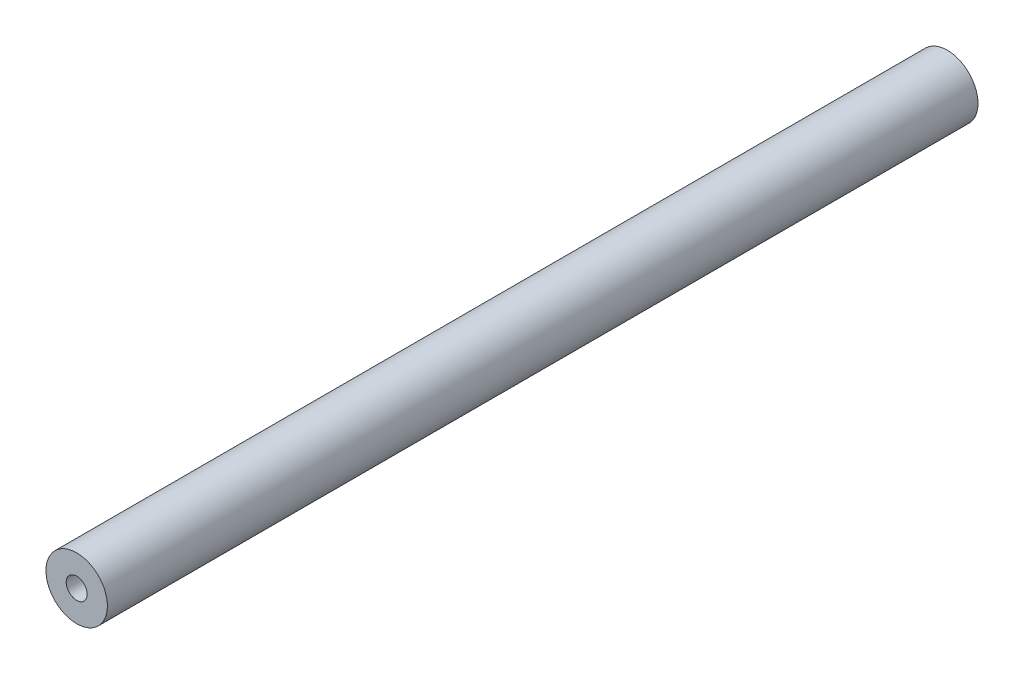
ISO-10303-21;
HEADER;
FILE_DESCRIPTION(('STEP AP214'),'2;1');
FILE_NAME('part.step','',(''),(''),'','','');
FILE_SCHEMA(('AUTOMOTIVE_DESIGN { 1 0 10303 214 1 1 1 1 }'));
ENDSEC;
DATA;
#1=APPLICATION_CONTEXT('core data for automotive mechanical design processes');
#2=APPLICATION_PROTOCOL_DEFINITION('international standard','automotive_design',2000,#1);
#3=PRODUCT_CONTEXT('',#1,'mechanical');
#4=PRODUCT('Part','Part','',(#3));
#5=PRODUCT_RELATED_PRODUCT_CATEGORY('part','',(#4));
#6=PRODUCT_DEFINITION_FORMATION('','',#4);
#7=PRODUCT_DEFINITION_CONTEXT('part definition',#1,'design');
#8=PRODUCT_DEFINITION('design','',#6,#7);
#9=PRODUCT_DEFINITION_SHAPE('','',#8);
#10=(LENGTH_UNIT() NAMED_UNIT(*) SI_UNIT(.MILLI.,.METRE.));
#11=(NAMED_UNIT(*) PLANE_ANGLE_UNIT() SI_UNIT($,.RADIAN.));
#12=(NAMED_UNIT(*) SI_UNIT($,.STERADIAN.) SOLID_ANGLE_UNIT());
#13=UNCERTAINTY_MEASURE_WITH_UNIT(LENGTH_MEASURE(1.E-05),#10,'distance_accuracy_value','');
#14=(GEOMETRIC_REPRESENTATION_CONTEXT(3) GLOBAL_UNCERTAINTY_ASSIGNED_CONTEXT((#13)) GLOBAL_UNIT_ASSIGNED_CONTEXT((#10,
#11,#12)) REPRESENTATION_CONTEXT('',''));
#15=CARTESIAN_POINT('',(0.,0.,0.));
#16=DIRECTION('',(0.,0.,1.));
#17=DIRECTION('',(1.,0.,0.));
#18=AXIS2_PLACEMENT_3D('',#15,#16,#17);
#19=CARTESIAN_POINT('',(0.,0.,85.));
#20=DIRECTION('',(0.,0.,-1.));
#21=DIRECTION('',(-1.,0.,0.));
#22=AXIS2_PLACEMENT_3D('',#19,#20,#21);
#23=CYLINDRICAL_SURFACE('',#22,3.);
#24=CARTESIAN_POINT('',(0.,0.,85.));
#25=DIRECTION('',(0.,0.,1.));
#26=DIRECTION('',(1.,0.,0.));
#27=AXIS2_PLACEMENT_3D('',#24,#25,#26);
#28=CIRCLE('',#27,3.);
#29=CARTESIAN_POINT('',(3.,0.,85.));
#30=VERTEX_POINT('',#29);
#31=EDGE_CURVE('E11',#30,#30,#28,.T.);
#32=ORIENTED_EDGE('',*,*,#31,.F.);
#33=EDGE_LOOP('',(#32));
#34=FACE_BOUND('',#33,.T.);
#35=CARTESIAN_POINT('',(0.,0.,0.));
#36=DIRECTION('',(0.,0.,1.));
#37=DIRECTION('',(1.,0.,0.));
#38=AXIS2_PLACEMENT_3D('',#35,#36,#37);
#39=CIRCLE('',#38,3.);
#40=CARTESIAN_POINT('',(3.,0.,0.));
#41=VERTEX_POINT('',#40);
#42=EDGE_CURVE('E41',#41,#41,#39,.T.);
#43=ORIENTED_EDGE('',*,*,#42,.T.);
#44=EDGE_LOOP('',(#43));
#45=FACE_BOUND('',#44,.T.);
#46=ADVANCED_FACE('F38',(#34,#45),#23,.T.);
#47=CARTESIAN_POINT('',(0.,0.,85.));
#48=DIRECTION('',(0.,0.,1.));
#49=DIRECTION('',(1.,0.,0.));
#50=AXIS2_PLACEMENT_3D('',#47,#48,#49);
#51=PLANE('',#50);
#52=CARTESIAN_POINT('',(0.,0.,85.));
#53=DIRECTION('',(0.,0.,1.));
#54=DIRECTION('',(1.,0.,0.));
#55=AXIS2_PLACEMENT_3D('',#52,#53,#54);
#56=CIRCLE('',#55,1.025);
#57=CARTESIAN_POINT('',(1.025,0.,85.));
#58=VERTEX_POINT('',#57);
#59=EDGE_CURVE('E63',#58,#58,#56,.T.);
#60=ORIENTED_EDGE('',*,*,#59,.F.);
#61=EDGE_LOOP('',(#60));
#62=FACE_BOUND('',#61,.T.);
#63=ORIENTED_EDGE('',*,*,#31,.T.);
#64=EDGE_LOOP('',(#63));
#65=FACE_BOUND('',#64,.T.);
#66=ADVANCED_FACE('F86',(#62,#65),#51,.T.);
#67=CARTESIAN_POINT('',(0.,0.,0.));
#68=DIRECTION('',(0.,0.,1.));
#69=DIRECTION('',(1.,0.,0.));
#70=AXIS2_PLACEMENT_3D('',#67,#68,#69);
#71=PLANE('',#70);
#72=CARTESIAN_POINT('',(0.,0.,0.));
#73=DIRECTION('',(0.,0.,-1.));
#74=DIRECTION('',(-1.,0.,0.));
#75=AXIS2_PLACEMENT_3D('',#72,#73,#74);
#76=CIRCLE('',#75,1.025);
#77=CARTESIAN_POINT('',(-1.025,0.,0.));
#78=VERTEX_POINT('',#77);
#79=EDGE_CURVE('E64',#78,#78,#76,.T.);
#80=ORIENTED_EDGE('',*,*,#79,.F.);
#81=EDGE_LOOP('',(#80));
#82=FACE_BOUND('',#81,.T.);
#83=ORIENTED_EDGE('',*,*,#42,.F.);
#84=EDGE_LOOP('',(#83));
#85=FACE_BOUND('',#84,.T.);
#86=ADVANCED_FACE('F83',(#82,#85),#71,.F.);
#87=CARTESIAN_POINT('',(0.,0.,77.));
#88=DIRECTION('',(0.,0.,1.));
#89=DIRECTION('',(1.,0.,0.));
#90=AXIS2_PLACEMENT_3D('',#87,#88,#89);
#91=CONICAL_SURFACE('',#90,1.025,1.02974425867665);
#92=CARTESIAN_POINT('',(0.,0.,76.3841178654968));
#93=VERTEX_POINT('',#92);
#94=VERTEX_LOOP('',#93);
#95=FACE_BOUND('',#94,.T.);
#96=CARTESIAN_POINT('',(0.,0.,77.));
#97=DIRECTION('',(0.,0.,1.));
#98=DIRECTION('',(1.,0.,0.));
#99=AXIS2_PLACEMENT_3D('',#96,#97,#98);
#100=CIRCLE('',#99,1.025);
#101=CARTESIAN_POINT('',(1.025,0.,77.));
#102=VERTEX_POINT('',#101);
#103=EDGE_CURVE('E69',#102,#102,#100,.T.);
#104=ORIENTED_EDGE('',*,*,#103,.T.);
#105=EDGE_LOOP('',(#104));
#106=FACE_BOUND('',#105,.T.);
#107=ADVANCED_FACE('F85',(#95,#106),#91,.F.);
#108=CARTESIAN_POINT('',(0.,0.,85.));
#109=DIRECTION('',(0.,0.,1.));
#110=DIRECTION('',(1.,0.,0.));
#111=AXIS2_PLACEMENT_3D('',#108,#109,#110);
#112=CYLINDRICAL_SURFACE('',#111,1.025);
#113=ORIENTED_EDGE('',*,*,#103,.F.);
#114=EDGE_LOOP('',(#113));
#115=FACE_BOUND('',#114,.T.);
#116=ORIENTED_EDGE('',*,*,#59,.T.);
#117=EDGE_LOOP('',(#116));
#118=FACE_BOUND('',#117,.T.);
#119=ADVANCED_FACE('F56',(#115,#118),#112,.F.);
#120=CARTESIAN_POINT('',(0.,0.,8.));
#121=DIRECTION('',(0.,0.,-1.));
#122=DIRECTION('',(-1.,0.,0.));
#123=AXIS2_PLACEMENT_3D('',#120,#121,#122);
#124=CONICAL_SURFACE('',#123,1.025,1.02974425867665);
#125=CARTESIAN_POINT('',(0.,0.,8.61588213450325));
#126=VERTEX_POINT('',#125);
#127=VERTEX_LOOP('',#126);
#128=FACE_BOUND('',#127,.T.);
#129=CARTESIAN_POINT('',(0.,0.,8.));
#130=DIRECTION('',(0.,0.,-1.));
#131=DIRECTION('',(-1.,0.,0.));
#132=AXIS2_PLACEMENT_3D('',#129,#130,#131);
#133=CIRCLE('',#132,1.025);
#134=CARTESIAN_POINT('',(-1.025,0.,8.));
#135=VERTEX_POINT('',#134);
#136=EDGE_CURVE('E60',#135,#135,#133,.T.);
#137=ORIENTED_EDGE('',*,*,#136,.T.);
#138=EDGE_LOOP('',(#137));
#139=FACE_BOUND('',#138,.T.);
#140=ADVANCED_FACE('F52',(#128,#139),#124,.F.);
#141=CARTESIAN_POINT('',(0.,0.,0.));
#142=DIRECTION('',(0.,0.,-1.));
#143=DIRECTION('',(-1.,0.,0.));
#144=AXIS2_PLACEMENT_3D('',#141,#142,#143);
#145=CYLINDRICAL_SURFACE('',#144,1.025);
#146=ORIENTED_EDGE('',*,*,#136,.F.);
#147=EDGE_LOOP('',(#146));
#148=FACE_BOUND('',#147,.T.);
#149=ORIENTED_EDGE('',*,*,#79,.T.);
#150=EDGE_LOOP('',(#149));
#151=FACE_BOUND('',#150,.T.);
#152=ADVANCED_FACE('F55',(#148,#151),#145,.F.);
#153=CLOSED_SHELL('',(#46,#66,#86,#107,#119,#140,#152));
#154=MANIFOLD_SOLID_BREP('B2',#153);
#155=ADVANCED_BREP_SHAPE_REPRESENTATION('',(#18,#154),#14);
#156=SHAPE_DEFINITION_REPRESENTATION(#9,#155);
ENDSEC;
END-ISO-10303-21;
